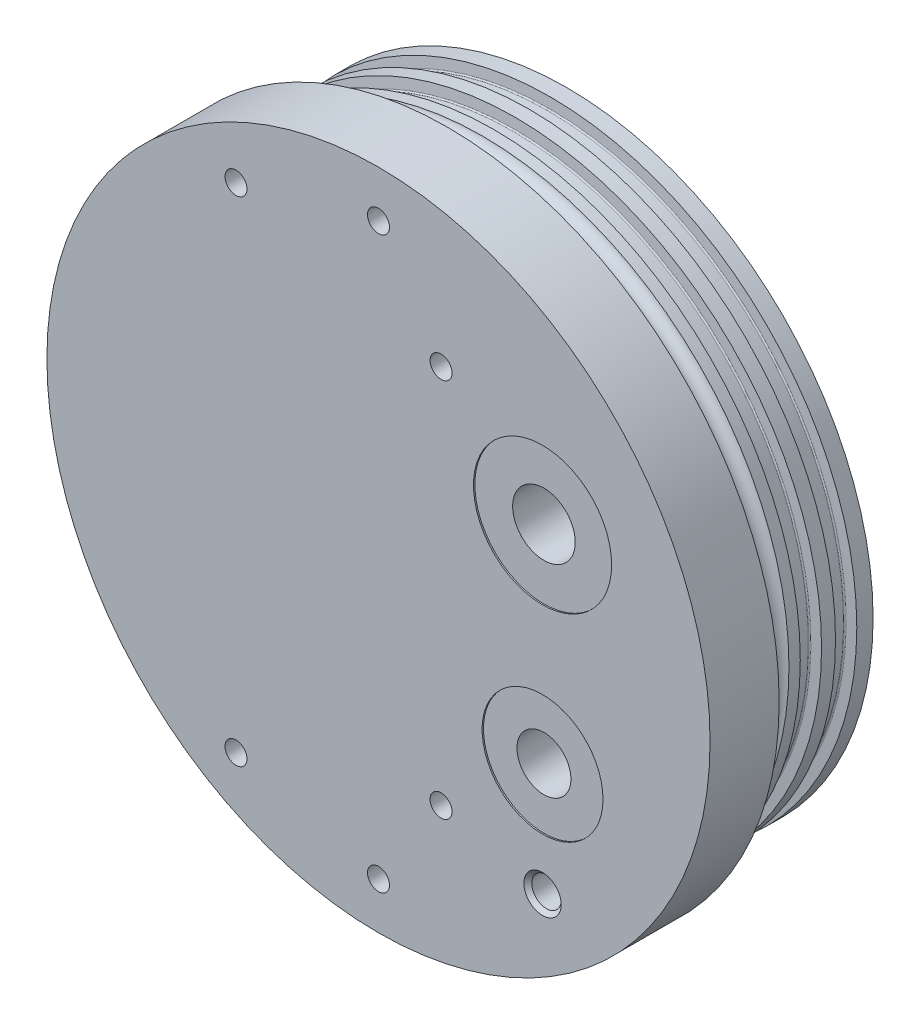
from build123d import *

# Parameters (mm, degrees)
SKETCH1_R                      = 60.96
BOSS_EXTRUDE1_DEPTH            = 12.7
F_7_16_20_TAPPED_HOLE1_D       = 9.92124
F_1_2_20_TAPPED_HOLE1_D        = 11.50874
SKETCH26_R                     = 11.1125
SKETCH26_R_2                   = 12.7
CUT_EXTRUDE1_DEPTH             = 0.254
CIRPATTERN1_COUNT              = 24
F_10_32_TAPPED_HOLE2_D         = 4.0386
F_10_32_TAPPED_HOLE2_DEPTH     = 12.0396
F_10_32_TAPPED_HOLE2_TIP       = 1.213317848
F_25_28_MIDDLE_D               = 5.4102
F_25_28_MIDDLE_DEPTH           = 8.89
F_25_28_MIDDLE_CSINK_D         = 6.85799406
F_25_28_MIDDLE_CSINK_ANGLE     = 90
F_1_16_0_0625_DIAMETER_HOLE1_D = 1.5875


with BuildPart() as part:
    # Sketch1 → Boss-Extrude1 (new body)
    with BuildSketch(Plane.XY):
        Circle(SKETCH1_R)
    extrude(amount=BOSS_EXTRUDE1_DEPTH)

    # Sketch3 → Revolve1 (revolve)
    with BuildSketch(Plane(origin=(0, 0, 0), x_dir=(0, 0, -1), z_dir=(1, 0, 0))):
        with BuildLine():
            Line((0, 56.7055), (0, 0))
            Line((0, 0), (3.175, 0))
            Line((3.175, 0), (3.175, 39.984786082))
            Line((3.175, 39.984786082), (21.9075, 50.8))
            Line((21.9075, 50.8), (21.9075, 56.3245))
            Line((21.9075, 56.3245), (18.910276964, 56.3245))
            Line((18.910276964, 56.3245), (18.752785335, 54.524362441))
            ThreePointArc((18.752785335, 54.524362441), (18.671351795, 54.359231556), (18.499751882, 54.2925))
            Line((18.499751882, 54.2925), (15.409248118, 54.2925))
            ThreePointArc((15.409248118, 54.2925), (15.237648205, 54.359231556), (15.156214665, 54.524362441))
            Line((15.156214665, 54.524362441), (14.998723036, 56.3245))
            Line((14.998723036, 56.3245), (12.433276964, 56.3245))
            Line((12.433276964, 56.3245), (12.275785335, 54.524362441))
            ThreePointArc((12.275785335, 54.524362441), (12.194351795, 54.359231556), (12.022751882, 54.2925))
            Line((12.022751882, 54.2925), (8.932248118, 54.2925))
            ThreePointArc((8.932248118, 54.2925), (8.760648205, 54.359231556), (8.679214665, 54.524362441))
            Line((8.679214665, 54.524362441), (8.521723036, 56.3245))
            Line((8.521723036, 56.3245), (6.438511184, 56.3245))
            ThreePointArc((6.438511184, 56.3245), (4.380530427, 54.810146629), (2.667, 56.7055))
            Line((2.667, 56.7055), (0, 56.7055))
        make_face()
    revolve(axis=Axis((0, 0, 0), (0, 0, 1)))

    # 7_16-20 Tapped Hole1 (through all)
    with Locations(Plane.XY.offset(12.7)):
        with Locations((30.1625, -19.05)):
            Hole(F_7_16_20_TAPPED_HOLE1_D / 2)

    # 1_2-20 Tapped Hole1 (through all)
    with Locations(Plane.XY.offset(12.7)):
        with Locations((30.1625, 19.05)):
            Hole(F_1_2_20_TAPPED_HOLE1_D / 2)

    # Sketch26 → Cut-Extrude1 (cut)
    with BuildSketch(Plane.XY.offset(12.7)):
        with Locations((30.1625, -19.05)):
            Circle(SKETCH26_R)
        with Locations((30.1625, 19.05)):
            Circle(SKETCH26_R_2)
    extrude(amount=-CUT_EXTRUDE1_DEPTH, mode=Mode.SUBTRACT)

    # Sketch6 → 10-32 Tapped Hole1 (revolve, cut)
    with BuildSketch(Plane(origin=(0, -52.3875, 12.7), x_dir=(0, -1, 0), z_dir=(1, 0, 0))):
        Polygon((0, 0), (0, 13.252917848), (2.0193, 12.0396), (2.0193, 0), align=None)
    f_10_32_tapped_hole1 = revolve(axis=Axis((0, -52.3875, 19.05), (0, 0, -1)), mode=Mode.SUBTRACT)

    # CirPattern1: 10-32 Tapped Hole1 ×24 about axis, 20 skipped
    cirpattern1_axis = Axis((0, 0, 0), (0, 0, -1))
    add([f_10_32_tapped_hole1.rotate(cirpattern1_axis, i * 360 / CIRPATTERN1_COUNT) for i in range(1, CIRPATTERN1_COUNT) if i not in (1, 3, 4, 5, 6, 7, 8, 9, 11, 13, 14, 15, 16, 17, 18, 19, 20, 21, 22, 23)], mode=Mode.SUBTRACT)

    # 10-32 Tapped Hole2
    with Locations(Plane.XY.offset(12.7)):
        with Locations((11.5062, 34.925), (11.5062, -34.925)):
            Hole(F_10_32_TAPPED_HOLE2_D / 2, depth=F_10_32_TAPPED_HOLE2_DEPTH)
            with Locations((0, 0, -(F_10_32_TAPPED_HOLE2_DEPTH + F_10_32_TAPPED_HOLE2_TIP / 2))):  # 118° drill point
                Cone(0, F_10_32_TAPPED_HOLE2_D / 2, F_10_32_TAPPED_HOLE2_TIP, mode=Mode.SUBTRACT)

    # 25-28 middle
    with Locations(Plane(origin=(15.327018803, -77.095950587, 12.7), x_dir=(1, 0, 0), z_dir=(0, 0, 1))):
        with Locations((14.835481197, 37.408450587)):
            CounterSinkHole(F_25_28_MIDDLE_D / 2, F_25_28_MIDDLE_CSINK_D / 2, depth=F_25_28_MIDDLE_DEPTH, counter_sink_angle=F_25_28_MIDDLE_CSINK_ANGLE)

    # 1_16 _0.0625_ Diameter Hole1 (through all)
    with Locations(Plane(origin=(29.2479528, 2.052430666, 3.81), x_dir=(1, 0, 0), z_dir=(0, 0, 1))):
        with Locations((0.9145472, -41.739930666)):
            Hole(F_1_16_0_0625_DIAMETER_HOLE1_D / 2)


solid = part.part
